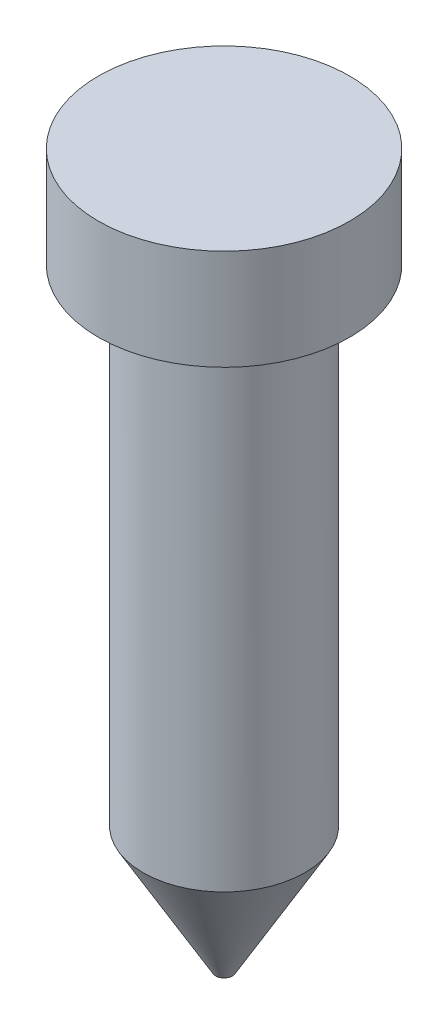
ISO-10303-21;
HEADER;
FILE_DESCRIPTION(('STEP AP214'),'2;1');
FILE_NAME('part.step','',(''),(''),'','','');
FILE_SCHEMA(('AUTOMOTIVE_DESIGN { 1 0 10303 214 1 1 1 1 }'));
ENDSEC;
DATA;
#1=APPLICATION_CONTEXT('core data for automotive mechanical design processes');
#2=APPLICATION_PROTOCOL_DEFINITION('international standard','automotive_design',2000,#1);
#3=PRODUCT_CONTEXT('',#1,'mechanical');
#4=PRODUCT('Part','Part','',(#3));
#5=PRODUCT_RELATED_PRODUCT_CATEGORY('part','',(#4));
#6=PRODUCT_DEFINITION_FORMATION('','',#4);
#7=PRODUCT_DEFINITION_CONTEXT('part definition',#1,'design');
#8=PRODUCT_DEFINITION('design','',#6,#7);
#9=PRODUCT_DEFINITION_SHAPE('','',#8);
#10=(LENGTH_UNIT() NAMED_UNIT(*) SI_UNIT(.MILLI.,.METRE.));
#11=(NAMED_UNIT(*) PLANE_ANGLE_UNIT() SI_UNIT($,.RADIAN.));
#12=(NAMED_UNIT(*) SI_UNIT($,.STERADIAN.) SOLID_ANGLE_UNIT());
#13=UNCERTAINTY_MEASURE_WITH_UNIT(LENGTH_MEASURE(1.E-05),#10,'distance_accuracy_value','');
#14=(GEOMETRIC_REPRESENTATION_CONTEXT(3) GLOBAL_UNCERTAINTY_ASSIGNED_CONTEXT((#13)) GLOBAL_UNIT_ASSIGNED_CONTEXT((#10,
#11,#12)) REPRESENTATION_CONTEXT('',''));
#15=CARTESIAN_POINT('',(0.,0.,0.));
#16=DIRECTION('',(0.,0.,1.));
#17=DIRECTION('',(1.,0.,0.));
#18=AXIS2_PLACEMENT_3D('',#15,#16,#17);
#19=CARTESIAN_POINT('',(-1.38777878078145E-13,11.1251999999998,0.));
#20=DIRECTION('',(0.,-1.,0.));
#21=DIRECTION('',(0.,0.,-1.));
#22=AXIS2_PLACEMENT_3D('',#19,#20,#21);
#23=CYLINDRICAL_SURFACE('',#22,1.4732);
#24=CARTESIAN_POINT('',(-1.38777878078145E-13,2.28769270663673,-1.04083408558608E-13));
#25=DIRECTION('',(0.,1.,0.));
#26=DIRECTION('',(0.,0.,1.));
#27=AXIS2_PLACEMENT_3D('',#24,#25,#26);
#28=CIRCLE('',#27,1.4732);
#29=CARTESIAN_POINT('',(-1.38777878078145E-13,2.28769270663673,-1.4732000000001));
#30=VERTEX_POINT('',#29);
#31=EDGE_CURVE('E34',#30,#30,#28,.T.);
#32=CARTESIAN_POINT('',(-1.38777878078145E-13,11.1251999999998,0.));
#33=DIRECTION('',(0.,1.,0.));
#34=DIRECTION('',(0.,0.,1.));
#35=AXIS2_PLACEMENT_3D('',#32,#33,#34);
#36=CIRCLE('',#35,1.4732);
#37=CARTESIAN_POINT('',(-1.38777878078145E-13,11.1251999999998,-1.4732000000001));
#38=VERTEX_POINT('',#37);
#39=EDGE_CURVE('E38',#38,#38,#36,.T.);
#40=CARTESIAN_POINT('',(-1.38777878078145E-13,2.28769270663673,-1.4732000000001));
#41=CARTESIAN_POINT('',(-1.38777878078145E-13,2.37975007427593,-1.4732000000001));
#42=CARTESIAN_POINT('',(-1.38777878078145E-13,2.47180744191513,-1.4732000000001));
#43=CARTESIAN_POINT('',(-1.38777878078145E-13,2.65592217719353,-1.4732000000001));
#44=CARTESIAN_POINT('',(-1.38777878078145E-13,2.74797954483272,-1.4732000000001));
#45=CARTESIAN_POINT('',(-1.38777878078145E-13,2.93209428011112,-1.4732000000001));
#46=CARTESIAN_POINT('',(-1.38777878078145E-13,3.02415164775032,-1.4732000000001));
#47=CARTESIAN_POINT('',(-1.38777878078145E-13,3.20826638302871,-1.4732000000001));
#48=CARTESIAN_POINT('',(-1.38777878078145E-13,3.30032375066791,-1.4732000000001));
#49=CARTESIAN_POINT('',(-1.38777878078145E-13,3.48443848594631,-1.4732000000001));
#50=CARTESIAN_POINT('',(-1.38777878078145E-13,3.57649585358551,-1.4732000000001));
#51=CARTESIAN_POINT('',(-1.38777878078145E-13,3.76061058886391,-1.4732000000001));
#52=CARTESIAN_POINT('',(-1.38777878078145E-13,3.8526679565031,-1.4732000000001));
#53=CARTESIAN_POINT('',(-1.38777878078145E-13,4.0367826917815,-1.4732000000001));
#54=CARTESIAN_POINT('',(-1.38777878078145E-13,4.1288400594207,-1.4732000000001));
#55=CARTESIAN_POINT('',(-1.38777878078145E-13,4.3129547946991,-1.4732000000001));
#56=CARTESIAN_POINT('',(-1.38777878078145E-13,4.40501216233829,-1.4732000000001));
#57=CARTESIAN_POINT('',(-1.38777878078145E-13,4.58912689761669,-1.4732000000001));
#58=CARTESIAN_POINT('',(-1.38777878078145E-13,4.68118426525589,-1.4732000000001));
#59=CARTESIAN_POINT('',(-1.38777878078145E-13,4.86529900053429,-1.4732000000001));
#60=CARTESIAN_POINT('',(-1.38777878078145E-13,4.95735636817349,-1.4732000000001));
#61=CARTESIAN_POINT('',(-1.38777878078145E-13,5.14147110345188,-1.4732000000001));
#62=CARTESIAN_POINT('',(-1.38777878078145E-13,5.23352847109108,-1.4732000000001));
#63=CARTESIAN_POINT('',(-1.38777878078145E-13,5.41764320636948,-1.4732000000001));
#64=CARTESIAN_POINT('',(-1.38777878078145E-13,5.50970057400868,-1.4732000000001));
#65=CARTESIAN_POINT('',(-1.38777878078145E-13,5.69381530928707,-1.4732000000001));
#66=CARTESIAN_POINT('',(-1.38777878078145E-13,5.78587267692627,-1.4732000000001));
#67=CARTESIAN_POINT('',(-1.38777878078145E-13,5.96998741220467,-1.4732000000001));
#68=CARTESIAN_POINT('',(-1.38777878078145E-13,6.06204477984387,-1.4732000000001));
#69=CARTESIAN_POINT('',(-1.38777878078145E-13,6.24615951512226,-1.4732000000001));
#70=CARTESIAN_POINT('',(-1.38777878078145E-13,6.33821688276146,-1.4732000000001));
#71=CARTESIAN_POINT('',(-1.38777878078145E-13,6.52233161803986,-1.4732000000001));
#72=CARTESIAN_POINT('',(-1.38777878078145E-13,6.61438898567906,-1.4732000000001));
#73=CARTESIAN_POINT('',(-1.38777878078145E-13,6.79850372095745,-1.4732000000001));
#74=CARTESIAN_POINT('',(-1.38777878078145E-13,6.89056108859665,-1.4732000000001));
#75=CARTESIAN_POINT('',(-1.38777878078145E-13,7.07467582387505,-1.4732000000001));
#76=CARTESIAN_POINT('',(-1.38777878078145E-13,7.16673319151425,-1.4732000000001));
#77=CARTESIAN_POINT('',(-1.38777878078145E-13,7.35084792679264,-1.4732000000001));
#78=CARTESIAN_POINT('',(-1.38777878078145E-13,7.44290529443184,-1.4732000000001));
#79=CARTESIAN_POINT('',(-1.38777878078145E-13,7.62702002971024,-1.4732000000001));
#80=CARTESIAN_POINT('',(-1.38777878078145E-13,7.71907739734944,-1.4732000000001));
#81=CARTESIAN_POINT('',(-1.38777878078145E-13,7.90319213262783,-1.4732000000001));
#82=CARTESIAN_POINT('',(-1.38777878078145E-13,7.99524950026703,-1.4732000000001));
#83=CARTESIAN_POINT('',(-1.38777878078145E-13,8.17936423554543,-1.4732000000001));
#84=CARTESIAN_POINT('',(-1.38777878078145E-13,8.27142160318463,-1.4732000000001));
#85=CARTESIAN_POINT('',(-1.38777878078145E-13,8.45553633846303,-1.4732000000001));
#86=CARTESIAN_POINT('',(-1.38777878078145E-13,8.54759370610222,-1.4732000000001));
#87=CARTESIAN_POINT('',(-1.38777878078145E-13,8.73170844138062,-1.4732000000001));
#88=CARTESIAN_POINT('',(-1.38777878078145E-13,8.82376580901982,-1.4732000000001));
#89=CARTESIAN_POINT('',(-1.38777878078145E-13,9.00788054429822,-1.4732000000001));
#90=CARTESIAN_POINT('',(-1.38777878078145E-13,9.09993791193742,-1.4732000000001));
#91=CARTESIAN_POINT('',(-1.38777878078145E-13,9.28405264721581,-1.4732000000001));
#92=CARTESIAN_POINT('',(-1.38777878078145E-13,9.37611001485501,-1.4732000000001));
#93=CARTESIAN_POINT('',(-1.38777878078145E-13,9.56022475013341,-1.4732000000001));
#94=CARTESIAN_POINT('',(-1.38777878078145E-13,9.65228211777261,-1.4732000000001));
#95=CARTESIAN_POINT('',(-1.38777878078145E-13,9.836396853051,-1.4732000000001));
#96=CARTESIAN_POINT('',(-1.38777878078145E-13,9.9284542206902,-1.4732000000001));
#97=CARTESIAN_POINT('',(-1.38777878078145E-13,10.1125689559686,-1.4732000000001));
#98=CARTESIAN_POINT('',(-1.38777878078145E-13,10.2046263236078,-1.4732000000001));
#99=CARTESIAN_POINT('',(-1.38777878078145E-13,10.3887410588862,-1.4732000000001));
#100=CARTESIAN_POINT('',(-1.38777878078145E-13,10.4807984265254,-1.4732000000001));
#101=CARTESIAN_POINT('',(-1.38777878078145E-13,10.6649131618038,-1.4732000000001));
#102=CARTESIAN_POINT('',(-1.38777878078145E-13,10.756970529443,-1.4732000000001));
#103=CARTESIAN_POINT('',(-1.38777878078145E-13,10.9410852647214,-1.4732000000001));
#104=CARTESIAN_POINT('',(-1.38777878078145E-13,11.0331426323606,-1.4732000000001));
#105=CARTESIAN_POINT('',(-1.38777878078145E-13,11.1251999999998,-1.4732000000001));
#106=B_SPLINE_CURVE_WITH_KNOTS('',3,(#40,#41,#42,#43,#44,#45,#46,#47,#48,#49,#50,#51,#52,#53,
#54,#55,#56,#57,#58,#59,#60,#61,#62,#63,#64,#65,#66,#67,#68,#69,#70,#71,#72,#73,#74,#75,#76,#77,
#78,#79,#80,#81,#82,#83,#84,#85,#86,#87,#88,#89,#90,#91,#92,#93,#94,#95,#96,#97,#98,#99,#100,
#101,#102,#103,#104,#105),.UNSPECIFIED.,.F.,.F.,(4,2,2,2,2,2,2,2,2,2,2,2,2,2,2,2,2,2,2,2,2,2,2,
2,2,2,2,2,2,2,2,2,4),(0.,0.276172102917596,0.552344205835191,0.828516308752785,1.10468841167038,
1.38086051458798,1.65703261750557,1.93320472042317,2.20937682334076,2.48554892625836,
2.76172102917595,3.03789313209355,3.31406523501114,3.59023733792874,3.86640944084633,
4.14258154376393,4.41875364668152,4.69492574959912,4.97109785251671,5.24726995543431,
5.5234420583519,5.7996141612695,6.0757862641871,6.35195836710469,6.62813047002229,
6.90430257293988,7.18047467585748,7.45664677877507,7.73281888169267,8.00899098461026,
8.28516308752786,8.56133519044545,8.83750729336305),.UNSPECIFIED.);
#107=EDGE_CURVE('BSEAM28',#30,#38,#106,.T.);
#108=ORIENTED_EDGE('',*,*,#31,.T.);
#109=ORIENTED_EDGE('',*,*,#39,.F.);
#110=ORIENTED_EDGE('',*,*,#107,.T.);
#111=ORIENTED_EDGE('',*,*,#107,.F.);
#112=EDGE_LOOP('',(#108,#110,#109,#111));
#113=FACE_BOUND('',#112,.T.);
#114=ADVANCED_FACE('F28',(#113),#23,.T.);
#115=CARTESIAN_POINT('',(0.,-2.22044604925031E-13,0.));
#116=DIRECTION('',(0.,1.,0.));
#117=DIRECTION('',(0.,0.,1.));
#118=AXIS2_PLACEMENT_3D('',#115,#116,#117);
#119=PLANE('',#118);
#120=CARTESIAN_POINT('',(0.,-2.22044604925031E-13,0.));
#121=DIRECTION('',(0.,1.,0.));
#122=DIRECTION('',(0.,0.,1.));
#123=AXIS2_PLACEMENT_3D('',#120,#121,#122);
#124=CIRCLE('',#123,0.15239999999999);
#125=CARTESIAN_POINT('',(0.,-2.22044604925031E-13,0.15239999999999));
#126=VERTEX_POINT('',#125);
#127=EDGE_CURVE('E10',#126,#126,#124,.F.);
#128=ORIENTED_EDGE('',*,*,#127,.T.);
#129=EDGE_LOOP('',(#128));
#130=FACE_BOUND('',#129,.T.);
#131=ADVANCED_FACE('F56',(#130),#119,.F.);
#132=CARTESIAN_POINT('',(-1.38777878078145E-13,11.1251999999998,0.));
#133=DIRECTION('',(0.,1.,0.));
#134=DIRECTION('',(0.,0.,1.));
#135=AXIS2_PLACEMENT_3D('',#132,#133,#134);
#136=PLANE('',#135);
#137=CARTESIAN_POINT('',(-1.38777878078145E-13,11.1251999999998,0.));
#138=DIRECTION('',(0.,1.,0.));
#139=DIRECTION('',(0.,0.,1.));
#140=AXIS2_PLACEMENT_3D('',#137,#138,#139);
#141=CIRCLE('',#140,2.286);
#142=CARTESIAN_POINT('',(-1.38777878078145E-13,11.1251999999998,2.2859999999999));
#143=VERTEX_POINT('',#142);
#144=EDGE_CURVE('E47',#143,#143,#141,.T.);
#145=ORIENTED_EDGE('',*,*,#144,.F.);
#146=EDGE_LOOP('',(#145));
#147=FACE_BOUND('',#146,.T.);
#148=ORIENTED_EDGE('',*,*,#39,.T.);
#149=EDGE_LOOP('',(#148));
#150=FACE_BOUND('',#149,.T.);
#151=ADVANCED_FACE('F53',(#147,#150),#136,.F.);
#152=CARTESIAN_POINT('',(0.,12.9539999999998,0.));
#153=DIRECTION('',(0.,-1.,0.));
#154=DIRECTION('',(0.,0.,-1.));
#155=AXIS2_PLACEMENT_3D('',#152,#153,#154);
#156=CYLINDRICAL_SURFACE('',#155,2.286);
#157=CARTESIAN_POINT('',(0.,12.9539999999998,0.));
#158=DIRECTION('',(0.,1.,0.));
#159=DIRECTION('',(0.,0.,1.));
#160=AXIS2_PLACEMENT_3D('',#157,#158,#159);
#161=CIRCLE('',#160,2.286);
#162=CARTESIAN_POINT('',(0.,12.9539999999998,2.28599999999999));
#163=VERTEX_POINT('',#162);
#164=EDGE_CURVE('E42',#163,#163,#161,.T.);
#165=ORIENTED_EDGE('',*,*,#164,.F.);
#166=EDGE_LOOP('',(#165));
#167=FACE_BOUND('',#166,.T.);
#168=ORIENTED_EDGE('',*,*,#144,.T.);
#169=EDGE_LOOP('',(#168));
#170=FACE_BOUND('',#169,.T.);
#171=ADVANCED_FACE('F51',(#167,#170),#156,.T.);
#172=CARTESIAN_POINT('',(0.,12.9539999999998,0.));
#173=DIRECTION('',(0.,1.,0.));
#174=DIRECTION('',(0.,0.,1.));
#175=AXIS2_PLACEMENT_3D('',#172,#173,#174);
#176=PLANE('',#175);
#177=ORIENTED_EDGE('',*,*,#164,.T.);
#178=EDGE_LOOP('',(#177));
#179=FACE_BOUND('',#178,.T.);
#180=ADVANCED_FACE('F69',(#179),#176,.T.);
#181=CARTESIAN_POINT('',(-1.38777878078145E-13,2.28769270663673,-1.04083408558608E-13));
#182=DIRECTION('',(0.,1.,0.));
#183=DIRECTION('',(0.,0.,1.));
#184=AXIS2_PLACEMENT_3D('',#181,#182,#183);
#185=CONICAL_SURFACE('',#184,1.4732,0.523598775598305);
#186=ORIENTED_EDGE('',*,*,#127,.F.);
#187=EDGE_LOOP('',(#186));
#188=FACE_BOUND('',#187,.T.);
#189=ORIENTED_EDGE('',*,*,#31,.F.);
#190=EDGE_LOOP('',(#189));
#191=FACE_BOUND('',#190,.T.);
#192=ADVANCED_FACE('F72',(#188,#191),#185,.T.);
#193=CLOSED_SHELL('',(#114,#131,#151,#171,#180,#192));
#194=MANIFOLD_SOLID_BREP('B2',#193);
#195=ADVANCED_BREP_SHAPE_REPRESENTATION('',(#18,#194),#14);
#196=SHAPE_DEFINITION_REPRESENTATION(#9,#195);
ENDSEC;
END-ISO-10303-21;
